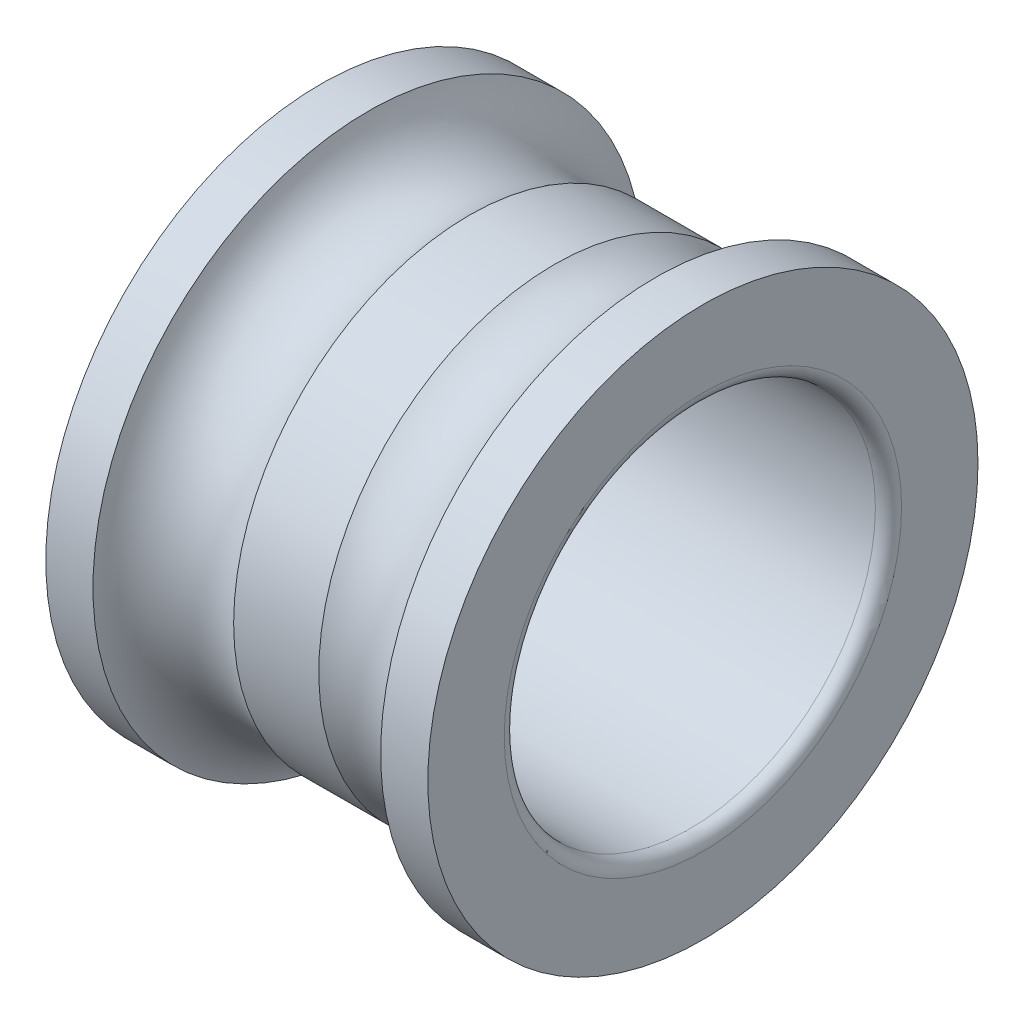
ISO-10303-21;
HEADER;
FILE_DESCRIPTION(('STEP AP214'),'2;1');
FILE_NAME('part.step','',(''),(''),'','','');
FILE_SCHEMA(('AUTOMOTIVE_DESIGN { 1 0 10303 214 1 1 1 1 }'));
ENDSEC;
DATA;
#1=APPLICATION_CONTEXT('core data for automotive mechanical design processes');
#2=APPLICATION_PROTOCOL_DEFINITION('international standard','automotive_design',2000,#1);
#3=PRODUCT_CONTEXT('',#1,'mechanical');
#4=PRODUCT('Part','Part','',(#3));
#5=PRODUCT_RELATED_PRODUCT_CATEGORY('part','',(#4));
#6=PRODUCT_DEFINITION_FORMATION('','',#4);
#7=PRODUCT_DEFINITION_CONTEXT('part definition',#1,'design');
#8=PRODUCT_DEFINITION('design','',#6,#7);
#9=PRODUCT_DEFINITION_SHAPE('','',#8);
#10=(LENGTH_UNIT() NAMED_UNIT(*) SI_UNIT(.MILLI.,.METRE.));
#11=(NAMED_UNIT(*) PLANE_ANGLE_UNIT() SI_UNIT($,.RADIAN.));
#12=(NAMED_UNIT(*) SI_UNIT($,.STERADIAN.) SOLID_ANGLE_UNIT());
#13=UNCERTAINTY_MEASURE_WITH_UNIT(LENGTH_MEASURE(1.E-05),#10,'distance_accuracy_value','');
#14=(GEOMETRIC_REPRESENTATION_CONTEXT(3) GLOBAL_UNCERTAINTY_ASSIGNED_CONTEXT((#13)) GLOBAL_UNIT_ASSIGNED_CONTEXT((#10,
#11,#12)) REPRESENTATION_CONTEXT('',''));
#15=CARTESIAN_POINT('',(0.,0.,0.));
#16=DIRECTION('',(0.,0.,1.));
#17=DIRECTION('',(1.,0.,0.));
#18=AXIS2_PLACEMENT_3D('',#15,#16,#17);
#19=CARTESIAN_POINT('',(0.,0.,0.));
#20=DIRECTION('',(1.,0.,0.));
#21=DIRECTION('',(0.,0.,-1.));
#22=AXIS2_PLACEMENT_3D('',#19,#20,#21);
#23=CYLINDRICAL_SURFACE('',#22,10.7953820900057);
#24=CARTESIAN_POINT('',(-1.95021241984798,0.,0.));
#25=DIRECTION('',(-1.,0.,0.));
#26=DIRECTION('',(0.,-1.,0.));
#27=AXIS2_PLACEMENT_3D('',#24,#25,#26);
#28=CIRCLE('',#27,10.7953820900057);
#29=CARTESIAN_POINT('',(-1.95021241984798,-10.7953820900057,0.));
#30=VERTEX_POINT('',#29);
#31=EDGE_CURVE('E159',#30,#30,#28,.T.);
#32=ORIENTED_EDGE('',*,*,#31,.F.);
#33=EDGE_LOOP('',(#32));
#34=FACE_BOUND('',#33,.T.);
#35=CARTESIAN_POINT('',(1.95021241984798,0.,0.));
#36=DIRECTION('',(1.,0.,0.));
#37=DIRECTION('',(0.,1.,0.));
#38=AXIS2_PLACEMENT_3D('',#35,#36,#37);
#39=CIRCLE('',#38,10.7953820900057);
#40=CARTESIAN_POINT('',(1.95021241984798,10.7953820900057,0.));
#41=VERTEX_POINT('',#40);
#42=EDGE_CURVE('E165',#41,#41,#39,.T.);
#43=ORIENTED_EDGE('',*,*,#42,.F.);
#44=EDGE_LOOP('',(#43));
#45=FACE_BOUND('',#44,.T.);
#46=ADVANCED_FACE('F16',(#34,#45),#23,.T.);
#47=CARTESIAN_POINT('',(-3.59561173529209,0.,0.));
#48=DIRECTION('',(1.,0.,0.));
#49=DIRECTION('',(0.,0.,-1.));
#50=AXIS2_PLACEMENT_3D('',#47,#48,#49);
#51=TOROIDAL_SURFACE('',#50,13.4285714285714,3.105);
#52=ORIENTED_EDGE('',*,*,#31,.T.);
#53=EDGE_LOOP('',(#52));
#54=FACE_BOUND('',#53,.T.);
#55=CARTESIAN_POINT('',(-6.58801785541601,0.,0.));
#56=DIRECTION('',(1.,0.,0.));
#57=DIRECTION('',(0.,0.,-1.));
#58=AXIS2_PLACEMENT_3D('',#55,#56,#57);
#59=CIRCLE('',#58,12.6);
#60=CARTESIAN_POINT('',(-6.58801785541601,0.,-12.6));
#61=VERTEX_POINT('',#60);
#62=EDGE_CURVE('E162',#61,#61,#59,.F.);
#63=ORIENTED_EDGE('',*,*,#62,.F.);
#64=EDGE_LOOP('',(#63));
#65=FACE_BOUND('',#64,.T.);
#66=ADVANCED_FACE('F146',(#54,#65),#51,.F.);
#67=CARTESIAN_POINT('',(3.59561173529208,0.,0.));
#68=DIRECTION('',(1.,0.,0.));
#69=DIRECTION('',(0.,0.,-1.));
#70=AXIS2_PLACEMENT_3D('',#67,#68,#69);
#71=TOROIDAL_SURFACE('',#70,13.4285714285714,3.105);
#72=ORIENTED_EDGE('',*,*,#42,.T.);
#73=EDGE_LOOP('',(#72));
#74=FACE_BOUND('',#73,.T.);
#75=CARTESIAN_POINT('',(6.58801785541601,0.,0.));
#76=DIRECTION('',(1.,0.,0.));
#77=DIRECTION('',(0.,0.,-1.));
#78=AXIS2_PLACEMENT_3D('',#75,#76,#77);
#79=CIRCLE('',#78,12.6);
#80=CARTESIAN_POINT('',(6.58801785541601,0.,-12.6));
#81=VERTEX_POINT('',#80);
#82=EDGE_CURVE('E164',#81,#81,#79,.T.);
#83=ORIENTED_EDGE('',*,*,#82,.F.);
#84=EDGE_LOOP('',(#83));
#85=FACE_BOUND('',#84,.T.);
#86=ADVANCED_FACE('F18',(#74,#85),#71,.F.);
#87=CARTESIAN_POINT('',(-7.669008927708,0.,0.));
#88=DIRECTION('',(1.,0.,0.));
#89=DIRECTION('',(0.,0.,-1.));
#90=AXIS2_PLACEMENT_3D('',#87,#88,#89);
#91=CYLINDRICAL_SURFACE('',#90,12.6);
#92=ORIENTED_EDGE('',*,*,#62,.T.);
#93=EDGE_LOOP('',(#92));
#94=FACE_BOUND('',#93,.T.);
#95=CARTESIAN_POINT('',(-8.75,0.,0.));
#96=DIRECTION('',(1.,0.,0.));
#97=DIRECTION('',(0.,0.,-1.));
#98=AXIS2_PLACEMENT_3D('',#95,#96,#97);
#99=CIRCLE('',#98,12.6);
#100=CARTESIAN_POINT('',(-8.75,0.,-12.6));
#101=VERTEX_POINT('',#100);
#102=EDGE_CURVE('E168',#101,#101,#99,.F.);
#103=ORIENTED_EDGE('',*,*,#102,.F.);
#104=EDGE_LOOP('',(#103));
#105=FACE_BOUND('',#104,.T.);
#106=ADVANCED_FACE('F151',(#94,#105),#91,.T.);
#107=CARTESIAN_POINT('',(7.669008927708,0.,0.));
#108=DIRECTION('',(1.,0.,0.));
#109=DIRECTION('',(0.,0.,-1.));
#110=AXIS2_PLACEMENT_3D('',#107,#108,#109);
#111=CYLINDRICAL_SURFACE('',#110,12.6);
#112=CARTESIAN_POINT('',(8.75,0.,0.));
#113=DIRECTION('',(1.,0.,0.));
#114=DIRECTION('',(0.,0.,-1.));
#115=AXIS2_PLACEMENT_3D('',#112,#113,#114);
#116=CIRCLE('',#115,12.6);
#117=CARTESIAN_POINT('',(8.75,0.,-12.6));
#118=VERTEX_POINT('',#117);
#119=EDGE_CURVE('E59',#118,#118,#116,.T.);
#120=ORIENTED_EDGE('',*,*,#119,.F.);
#121=EDGE_LOOP('',(#120));
#122=FACE_BOUND('',#121,.T.);
#123=ORIENTED_EDGE('',*,*,#82,.T.);
#124=EDGE_LOOP('',(#123));
#125=FACE_BOUND('',#124,.T.);
#126=ADVANCED_FACE('F85',(#122,#125),#111,.T.);
#127=CARTESIAN_POINT('',(-8.75,10.85,0.));
#128=DIRECTION('',(-1.,0.,0.));
#129=DIRECTION('',(0.,0.,1.));
#130=AXIS2_PLACEMENT_3D('',#127,#128,#129);
#131=PLANE('',#130);
#132=CARTESIAN_POINT('',(-8.75,0.,0.));
#133=DIRECTION('',(-1.,0.,0.));
#134=DIRECTION('',(0.,0.,-1.));
#135=AXIS2_PLACEMENT_3D('',#132,#133,#134);
#136=CIRCLE('',#135,9.1);
#137=CARTESIAN_POINT('',(-8.75,0.,-9.1));
#138=VERTEX_POINT('',#137);
#139=CARTESIAN_POINT('',(-8.75,0.,9.1));
#140=VERTEX_POINT('',#139);
#141=EDGE_CURVE('E55',#138,#140,#136,.T.);
#142=ORIENTED_EDGE('',*,*,#141,.F.);
#143=CARTESIAN_POINT('',(-8.75,0.,0.));
#144=DIRECTION('',(-1.,0.,0.));
#145=DIRECTION('',(0.,1.,0.));
#146=AXIS2_PLACEMENT_3D('',#143,#144,#145);
#147=CIRCLE('',#146,9.1);
#148=CARTESIAN_POINT('',(-8.75,9.1,0.));
#149=VERTEX_POINT('',#148);
#150=EDGE_CURVE('E52',#149,#138,#147,.T.);
#151=ORIENTED_EDGE('',*,*,#150,.F.);
#152=CARTESIAN_POINT('',(-8.75,0.,0.));
#153=DIRECTION('',(-1.,0.,0.));
#154=DIRECTION('',(0.,0.,1.));
#155=AXIS2_PLACEMENT_3D('',#152,#153,#154);
#156=CIRCLE('',#155,9.1);
#157=EDGE_CURVE('E47',#140,#149,#156,.T.);
#158=ORIENTED_EDGE('',*,*,#157,.F.);
#159=EDGE_LOOP('',(#142,#151,#158));
#160=FACE_BOUND('',#159,.T.);
#161=ORIENTED_EDGE('',*,*,#102,.T.);
#162=EDGE_LOOP('',(#161));
#163=FACE_BOUND('',#162,.T.);
#164=ADVANCED_FACE('F63',(#160,#163),#131,.T.);
#165=CARTESIAN_POINT('',(8.75,10.85,0.));
#166=DIRECTION('',(1.,0.,0.));
#167=DIRECTION('',(0.,0.,-1.));
#168=AXIS2_PLACEMENT_3D('',#165,#166,#167);
#169=PLANE('',#168);
#170=CARTESIAN_POINT('',(8.75,0.,0.));
#171=DIRECTION('',(1.,0.,0.));
#172=DIRECTION('',(0.,0.,-1.));
#173=AXIS2_PLACEMENT_3D('',#170,#171,#172);
#174=CIRCLE('',#173,9.1);
#175=CARTESIAN_POINT('',(8.75,0.,-9.1));
#176=VERTEX_POINT('',#175);
#177=CARTESIAN_POINT('',(8.75,9.1,0.));
#178=VERTEX_POINT('',#177);
#179=EDGE_CURVE('E120',#176,#178,#174,.T.);
#180=ORIENTED_EDGE('',*,*,#179,.F.);
#181=CARTESIAN_POINT('',(8.75,0.,0.));
#182=DIRECTION('',(1.,0.,0.));
#183=DIRECTION('',(0.,0.,1.));
#184=AXIS2_PLACEMENT_3D('',#181,#182,#183);
#185=CIRCLE('',#184,9.1);
#186=CARTESIAN_POINT('',(8.75,0.,9.1));
#187=VERTEX_POINT('',#186);
#188=EDGE_CURVE('E128',#187,#176,#185,.T.);
#189=ORIENTED_EDGE('',*,*,#188,.F.);
#190=CARTESIAN_POINT('',(8.75,0.,0.));
#191=DIRECTION('',(1.,0.,0.));
#192=DIRECTION('',(0.,1.,0.));
#193=AXIS2_PLACEMENT_3D('',#190,#191,#192);
#194=CIRCLE('',#193,9.1);
#195=EDGE_CURVE('E33',#178,#187,#194,.T.);
#196=ORIENTED_EDGE('',*,*,#195,.F.);
#197=EDGE_LOOP('',(#180,#189,#196));
#198=FACE_BOUND('',#197,.T.);
#199=ORIENTED_EDGE('',*,*,#119,.T.);
#200=EDGE_LOOP('',(#199));
#201=FACE_BOUND('',#200,.T.);
#202=ADVANCED_FACE('F84',(#198,#201),#169,.T.);
#203=CARTESIAN_POINT('',(-8.15,0.,0.));
#204=DIRECTION('',(1.,0.,0.));
#205=DIRECTION('',(0.,0.,-1.));
#206=AXIS2_PLACEMENT_3D('',#203,#204,#205);
#207=TOROIDAL_SURFACE('',#206,9.1,0.6);
#208=ORIENTED_EDGE('',*,*,#150,.T.);
#209=ORIENTED_EDGE('',*,*,#141,.T.);
#210=ORIENTED_EDGE('',*,*,#157,.T.);
#211=EDGE_LOOP('',(#208,#209,#210));
#212=FACE_BOUND('',#211,.T.);
#213=CARTESIAN_POINT('',(-8.15,0.,0.));
#214=DIRECTION('',(1.,0.,0.));
#215=DIRECTION('',(0.,0.,-1.));
#216=AXIS2_PLACEMENT_3D('',#213,#214,#215);
#217=CIRCLE('',#216,8.5);
#218=CARTESIAN_POINT('',(-8.15,0.,-8.5));
#219=VERTEX_POINT('',#218);
#220=EDGE_CURVE('E20',#219,#219,#217,.T.);
#221=ORIENTED_EDGE('',*,*,#220,.T.);
#222=EDGE_LOOP('',(#221));
#223=FACE_BOUND('',#222,.T.);
#224=ADVANCED_FACE('F50',(#212,#223),#207,.T.);
#225=CARTESIAN_POINT('',(8.15,0.,0.));
#226=DIRECTION('',(1.,0.,0.));
#227=DIRECTION('',(0.,0.,-1.));
#228=AXIS2_PLACEMENT_3D('',#225,#226,#227);
#229=TOROIDAL_SURFACE('',#228,9.1,0.6);
#230=ORIENTED_EDGE('',*,*,#188,.T.);
#231=ORIENTED_EDGE('',*,*,#179,.T.);
#232=ORIENTED_EDGE('',*,*,#195,.T.);
#233=EDGE_LOOP('',(#230,#231,#232));
#234=FACE_BOUND('',#233,.T.);
#235=CARTESIAN_POINT('',(8.15,0.,0.));
#236=DIRECTION('',(1.,0.,0.));
#237=DIRECTION('',(0.,0.,-1.));
#238=AXIS2_PLACEMENT_3D('',#235,#236,#237);
#239=CIRCLE('',#238,8.5);
#240=CARTESIAN_POINT('',(8.15,0.,-8.5));
#241=VERTEX_POINT('',#240);
#242=EDGE_CURVE('E10',#241,#241,#239,.F.);
#243=ORIENTED_EDGE('',*,*,#242,.T.);
#244=EDGE_LOOP('',(#243));
#245=FACE_BOUND('',#244,.T.);
#246=ADVANCED_FACE('F137',(#234,#245),#229,.T.);
#247=CARTESIAN_POINT('',(0.,0.,0.));
#248=DIRECTION('',(1.,0.,0.));
#249=DIRECTION('',(0.,0.,-1.));
#250=AXIS2_PLACEMENT_3D('',#247,#248,#249);
#251=CYLINDRICAL_SURFACE('',#250,8.5);
#252=ORIENTED_EDGE('',*,*,#242,.F.);
#253=EDGE_LOOP('',(#252));
#254=FACE_BOUND('',#253,.T.);
#255=ORIENTED_EDGE('',*,*,#220,.F.);
#256=EDGE_LOOP('',(#255));
#257=FACE_BOUND('',#256,.T.);
#258=ADVANCED_FACE('F135',(#254,#257),#251,.F.);
#259=CLOSED_SHELL('',(#46,#66,#86,#106,#126,#164,#202,#224,#246,#258));
#260=MANIFOLD_SOLID_BREP('B1',#259);
#261=ADVANCED_BREP_SHAPE_REPRESENTATION('',(#18,#260),#14);
#262=SHAPE_DEFINITION_REPRESENTATION(#9,#261);
ENDSEC;
END-ISO-10303-21;
